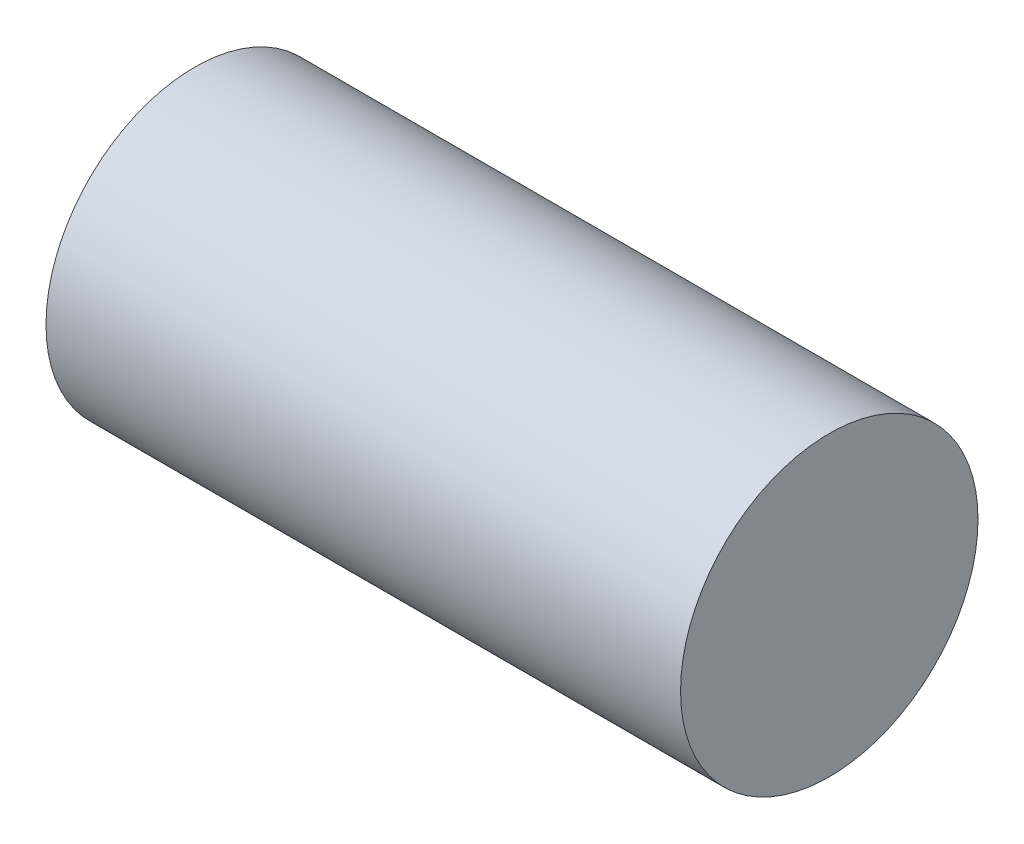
ISO-10303-21;
HEADER;
FILE_DESCRIPTION(('STEP AP214'),'2;1');
FILE_NAME('part.step','',(''),(''),'','','');
FILE_SCHEMA(('AUTOMOTIVE_DESIGN { 1 0 10303 214 1 1 1 1 }'));
ENDSEC;
DATA;
#1=APPLICATION_CONTEXT('core data for automotive mechanical design processes');
#2=APPLICATION_PROTOCOL_DEFINITION('international standard','automotive_design',2000,#1);
#3=PRODUCT_CONTEXT('',#1,'mechanical');
#4=PRODUCT('Part','Part','',(#3));
#5=PRODUCT_RELATED_PRODUCT_CATEGORY('part','',(#4));
#6=PRODUCT_DEFINITION_FORMATION('','',#4);
#7=PRODUCT_DEFINITION_CONTEXT('part definition',#1,'design');
#8=PRODUCT_DEFINITION('design','',#6,#7);
#9=PRODUCT_DEFINITION_SHAPE('','',#8);
#10=(LENGTH_UNIT() NAMED_UNIT(*) SI_UNIT(.MILLI.,.METRE.));
#11=(NAMED_UNIT(*) PLANE_ANGLE_UNIT() SI_UNIT($,.RADIAN.));
#12=(NAMED_UNIT(*) SI_UNIT($,.STERADIAN.) SOLID_ANGLE_UNIT());
#13=UNCERTAINTY_MEASURE_WITH_UNIT(LENGTH_MEASURE(1.E-05),#10,'distance_accuracy_value','');
#14=(GEOMETRIC_REPRESENTATION_CONTEXT(3) GLOBAL_UNCERTAINTY_ASSIGNED_CONTEXT((#13)) GLOBAL_UNIT_ASSIGNED_CONTEXT((#10,
#11,#12)) REPRESENTATION_CONTEXT('',''));
#15=CARTESIAN_POINT('',(0.,0.,0.));
#16=DIRECTION('',(0.,0.,1.));
#17=DIRECTION('',(1.,0.,0.));
#18=AXIS2_PLACEMENT_3D('',#15,#16,#17);
#19=CARTESIAN_POINT('',(20.32,0.,0.));
#20=DIRECTION('',(-1.,0.,0.));
#21=DIRECTION('',(0.,0.,1.));
#22=AXIS2_PLACEMENT_3D('',#19,#20,#21);
#23=CYLINDRICAL_SURFACE('',#22,4.7625);
#24=CARTESIAN_POINT('',(20.32,0.,0.));
#25=DIRECTION('',(1.,0.,0.));
#26=DIRECTION('',(0.,0.,-1.));
#27=AXIS2_PLACEMENT_3D('',#24,#25,#26);
#28=CIRCLE('',#27,4.7625);
#29=CARTESIAN_POINT('',(20.32,0.,-4.7625));
#30=VERTEX_POINT('',#29);
#31=EDGE_CURVE('E10',#30,#30,#28,.T.);
#32=ORIENTED_EDGE('',*,*,#31,.F.);
#33=EDGE_LOOP('',(#32));
#34=FACE_BOUND('',#33,.T.);
#35=CARTESIAN_POINT('',(0.,0.,0.));
#36=DIRECTION('',(1.,0.,0.));
#37=DIRECTION('',(0.,0.,-1.));
#38=AXIS2_PLACEMENT_3D('',#35,#36,#37);
#39=CIRCLE('',#38,4.7625);
#40=CARTESIAN_POINT('',(0.,0.,-4.7625));
#41=VERTEX_POINT('',#40);
#42=EDGE_CURVE('E36',#41,#41,#39,.T.);
#43=ORIENTED_EDGE('',*,*,#42,.T.);
#44=EDGE_LOOP('',(#43));
#45=FACE_BOUND('',#44,.T.);
#46=ADVANCED_FACE('F33',(#34,#45),#23,.T.);
#47=CARTESIAN_POINT('',(20.32,0.,0.));
#48=DIRECTION('',(1.,0.,0.));
#49=DIRECTION('',(0.,0.,-1.));
#50=AXIS2_PLACEMENT_3D('',#47,#48,#49);
#51=PLANE('',#50);
#52=ORIENTED_EDGE('',*,*,#31,.T.);
#53=EDGE_LOOP('',(#52));
#54=FACE_BOUND('',#53,.T.);
#55=ADVANCED_FACE('F48',(#54),#51,.T.);
#56=CARTESIAN_POINT('',(0.,0.,0.));
#57=DIRECTION('',(1.,0.,0.));
#58=DIRECTION('',(0.,0.,-1.));
#59=AXIS2_PLACEMENT_3D('',#56,#57,#58);
#60=PLANE('',#59);
#61=ORIENTED_EDGE('',*,*,#42,.F.);
#62=EDGE_LOOP('',(#61));
#63=FACE_BOUND('',#62,.T.);
#64=ADVANCED_FACE('F46',(#63),#60,.F.);
#65=CLOSED_SHELL('',(#46,#55,#64));
#66=MANIFOLD_SOLID_BREP('B2',#65);
#67=ADVANCED_BREP_SHAPE_REPRESENTATION('',(#18,#66),#14);
#68=SHAPE_DEFINITION_REPRESENTATION(#9,#67);
ENDSEC;
END-ISO-10303-21;
